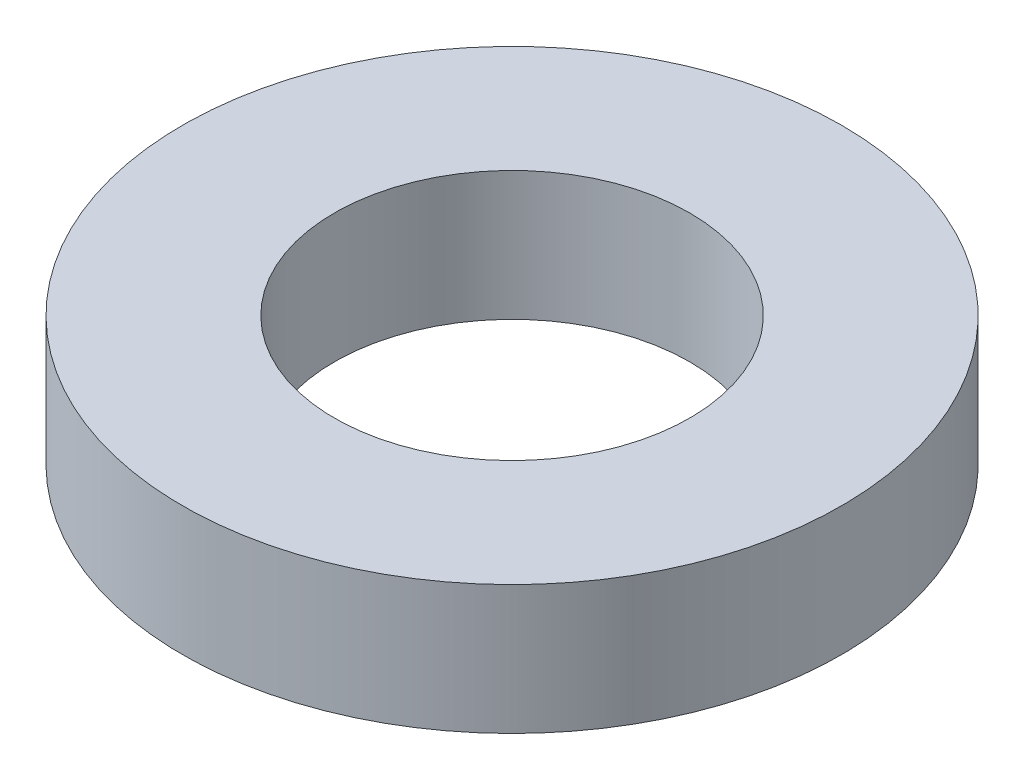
from build123d import *

# Parameters (mm, degrees)
SKETCH1_W = 1.3462
SKETCH1_H = 1.143


with BuildPart() as part:
    # Sketch1 → Revolve2 (revolve)
    with BuildSketch(Plane.XY, mode=Mode.PRIVATE) as revolve2_sk:
        with Locations((2.2479, 0)):
            Rectangle(SKETCH1_W, SKETCH1_H)
    revolve(revolve2_sk.sketch.rotate(Axis((0, -11.412625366, 0), (0, 1, 0)), 90), axis=Axis((0, -11.412625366, 0), (0, 1, 0)))


solid = part.part
